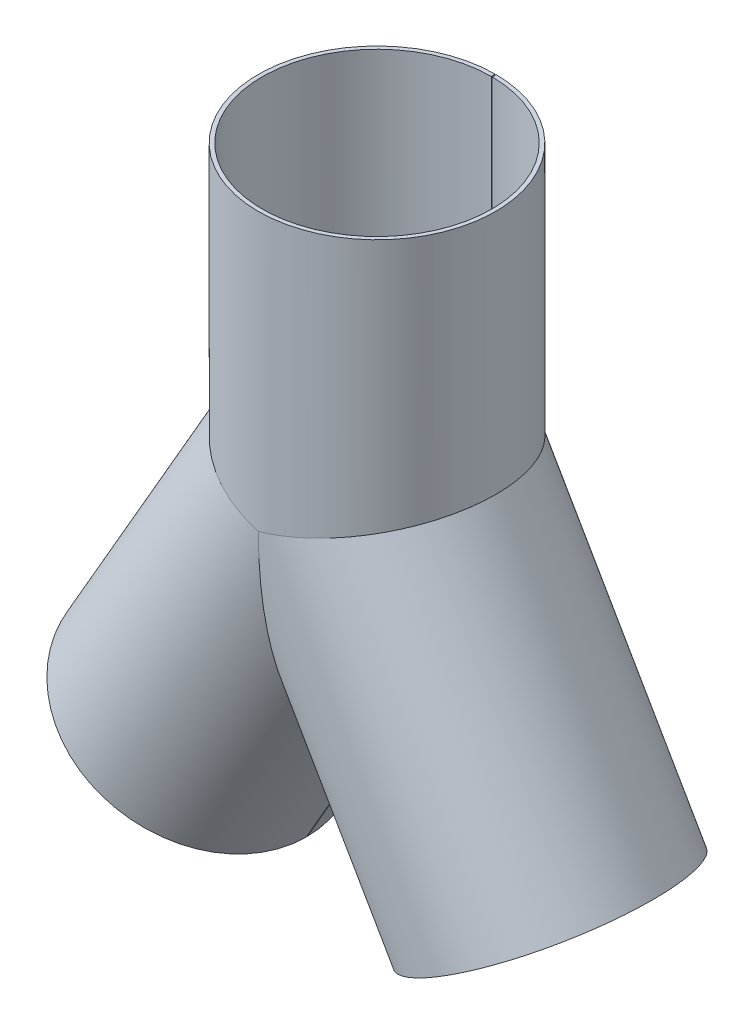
from build123d import *

# Parameters (mm, degrees)
SKETCH_2_R               = 120
SKETCH_2_R_2             = 116
EXTRUDE_1_DEPTH          = 280
SKETCH_3_R               = 120
SKETCH_3_R_2             = 116
EXTRUDE_2_DEPTH          = 350
CUT_EXTRUDE_3_DEPTH      = 474.335117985
CUT_EXTRUDE_3_DEPTH_BACK = 474.335117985
CUT_EXTRUDE_4_DEPTH      = 474.335117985
CUT_EXTRUDE_4_DEPTH_BACK = 474.335117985
CUT_EXTRUDE_5_DEPTH      = 474.335117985
CUT_EXTRUDE_5_DEPTH_BACK = 474.335117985
CUT_EXTRUDE_6_DEPTH      = 474.335117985
CUT_EXTRUDE_6_DEPTH_BACK = 474.335117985
SKETCH_1_W               = 1
SKETCH_1_H               = 280
CUT_EXTRUDE_2_DEPTH      = 474.335117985
SKETCH_7_W               = 120
SKETCH_7_H               = 1
CUT_EXTRUDE_3_2_DEPTH    = 665.410249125


with BuildPart() as part:
    # Sketch 2 → Extrude 1 (new body)
    with BuildSketch(Plane(origin=(0, 0, 0), x_dir=(1, 0, 0), z_dir=(0, 1, 0))):
        Circle(SKETCH_2_R)
        Circle(SKETCH_2_R_2, mode=Mode.SUBTRACT)
    extrude(amount=EXTRUDE_1_DEPTH)

    # Sketch 4 → Cut-Extrude 3 (cut, two sides: drawn at the far end of the back side and taken through both)
    with BuildSketch(Plane.XY.offset(-CUT_EXTRUDE_3_DEPTH_BACK)):
        Polygon((-1658.565462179, 444.411276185), (-278.923048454, 74.737205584), (278.923048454, -74.737205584), (1658.565462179, -444.411276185), (919.217320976, -3203.696103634), (-2397.913603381, -2314.873551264), align=None)
    extrude(amount=CUT_EXTRUDE_3_DEPTH + CUT_EXTRUDE_3_DEPTH_BACK, mode=Mode.SUBTRACT)

    # Sketch 5 → Cut-Extrude 4 (cut, two sides: drawn at the far end of the back side and taken through both)
    with BuildSketch(Plane.XY.offset(-CUT_EXTRUDE_4_DEPTH_BACK)):
        Polygon((1565.69662194, 419.527145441), (278.923048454, 74.737205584), (-278.923048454, -74.737205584), (-1565.69662194, -419.527145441), (-876.116742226, -2993.074292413), (2255.276501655, -2154.020001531), align=None)
    extrude(amount=CUT_EXTRUDE_4_DEPTH + CUT_EXTRUDE_4_DEPTH_BACK, mode=Mode.SUBTRACT)

    # Sketch 1 → Cut-Extrude 2 (cut, through all)
    with BuildSketch(Plane.XY):
        with Locations((0, 140)):
            Rectangle(SKETCH_1_W, SKETCH_1_H)
    extrude(amount=-CUT_EXTRUDE_2_DEPTH, mode=Mode.SUBTRACT)


with BuildPart() as body_2:
    # Sketch 3 → Extrude 2 (new body)
    with BuildSketch(Plane(origin=(175, -303.108891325, 0), x_dir=(0.8660254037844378, 0.5000000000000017, 0), z_dir=(0.5000000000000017, -0.8660254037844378, 0))):
        Circle(SKETCH_3_R)
        Circle(SKETCH_3_R_2, mode=Mode.SUBTRACT)
    extrude(amount=-EXTRUDE_2_DEPTH)

    # Sketch 5_2 → Cut-Extrude 5 (cut, two sides: drawn at the far end of the back side and taken through both)
    with BuildSketch(Plane.XY.offset(-CUT_EXTRUDE_5_DEPTH_BACK)):
        Polygon((1565.69662194, 419.527145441), (278.923048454, 74.737205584), (-278.923048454, -74.737205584), (-1565.69662194, -419.527145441), (-2255.276501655, 2154.020001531), (876.116742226, 2993.074292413), align=None)
    extrude(amount=CUT_EXTRUDE_5_DEPTH + CUT_EXTRUDE_5_DEPTH_BACK, mode=Mode.SUBTRACT)

    # Sketch 6 → Cut-Extrude 6 (cut, two sides: drawn at the far end of the back side and taken through both)
    with BuildSketch(Plane.XY.offset(-CUT_EXTRUDE_6_DEPTH_BACK)):
        Polygon((0, 1691.980189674), (0, 280), (0, -363.108891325), (0, -1775.089080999), (-2823.960379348, -1775.089080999), (-2823.960379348, 1691.980189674), align=None)
    extrude(amount=CUT_EXTRUDE_6_DEPTH + CUT_EXTRUDE_6_DEPTH_BACK, mode=Mode.SUBTRACT)

    # Sketch 7 → Cut-Extrude 3 2 (cut, through all)
    with BuildSketch(Plane(origin=(175, -303.108891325, 0), x_dir=(0.8660254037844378, 0.5000000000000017, 0), z_dir=(0.5000000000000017, -0.8660254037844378, 0))):
        with Locations((-60, 0)):
            Rectangle(SKETCH_7_W, SKETCH_7_H)
    extrude(amount=-CUT_EXTRUDE_3_2_DEPTH, mode=Mode.SUBTRACT)


with BuildPart() as body_3:
    # Mirror 1: mirrored copy
    add(body_2.part.mirror(Plane(origin=(0, 0, 0), x_dir=(0, 0, 1), z_dir=(1, 0, 0))))


solid = Compound([part.part, body_2.part, body_3.part])
